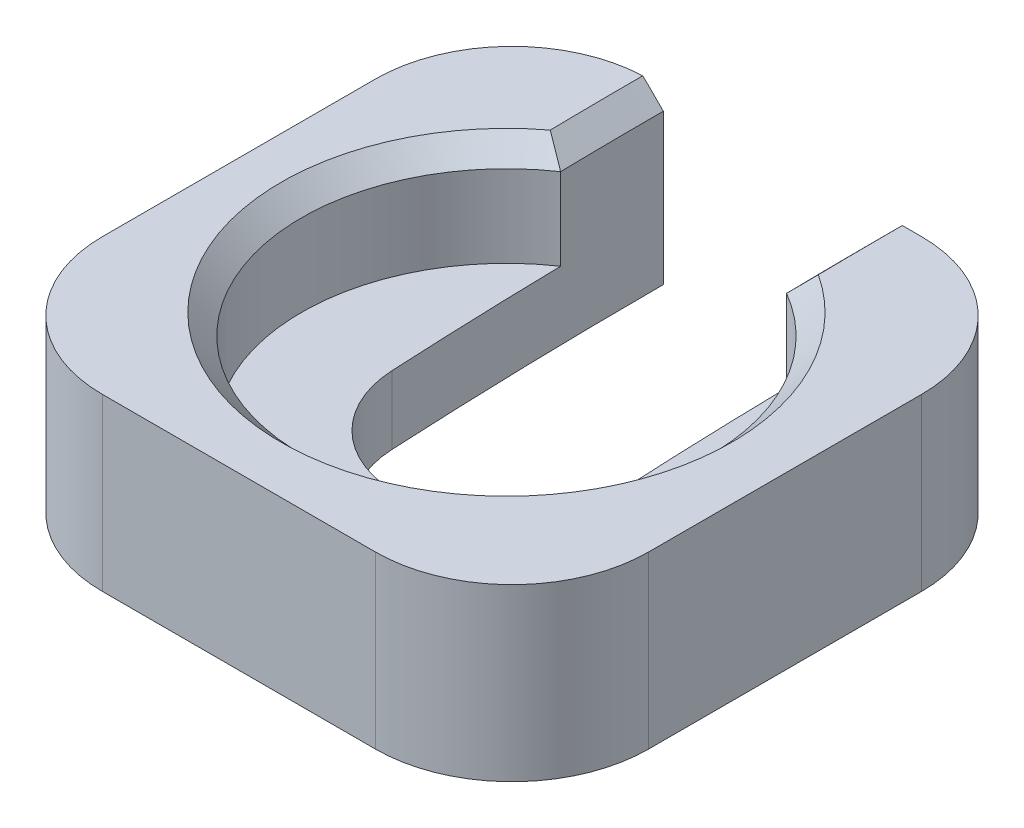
ISO-10303-21;
HEADER;
FILE_DESCRIPTION(('STEP AP214'),'2;1');
FILE_NAME('part.step','',(''),(''),'','','');
FILE_SCHEMA(('AUTOMOTIVE_DESIGN { 1 0 10303 214 1 1 1 1 }'));
ENDSEC;
DATA;
#1=APPLICATION_CONTEXT('core data for automotive mechanical design processes');
#2=APPLICATION_PROTOCOL_DEFINITION('international standard','automotive_design',2000,#1);
#3=PRODUCT_CONTEXT('',#1,'mechanical');
#4=PRODUCT('Part','Part','',(#3));
#5=PRODUCT_RELATED_PRODUCT_CATEGORY('part','',(#4));
#6=PRODUCT_DEFINITION_FORMATION('','',#4);
#7=PRODUCT_DEFINITION_CONTEXT('part definition',#1,'design');
#8=PRODUCT_DEFINITION('design','',#6,#7);
#9=PRODUCT_DEFINITION_SHAPE('','',#8);
#10=(LENGTH_UNIT() NAMED_UNIT(*) SI_UNIT(.MILLI.,.METRE.));
#11=(NAMED_UNIT(*) PLANE_ANGLE_UNIT() SI_UNIT($,.RADIAN.));
#12=(NAMED_UNIT(*) SI_UNIT($,.STERADIAN.) SOLID_ANGLE_UNIT());
#13=UNCERTAINTY_MEASURE_WITH_UNIT(LENGTH_MEASURE(1.E-05),#10,'distance_accuracy_value','');
#14=(GEOMETRIC_REPRESENTATION_CONTEXT(3) GLOBAL_UNCERTAINTY_ASSIGNED_CONTEXT((#13)) GLOBAL_UNIT_ASSIGNED_CONTEXT((#10,
#11,#12)) REPRESENTATION_CONTEXT('',''));
#15=CARTESIAN_POINT('',(0.,0.,0.));
#16=DIRECTION('',(0.,0.,1.));
#17=DIRECTION('',(1.,0.,0.));
#18=AXIS2_PLACEMENT_3D('',#15,#16,#17);
#19=CARTESIAN_POINT('',(-0.0814249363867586,2.5,4.));
#20=DIRECTION('',(0.,-1.,0.));
#21=DIRECTION('',(0.,0.,-1.));
#22=AXIS2_PLACEMENT_3D('',#19,#20,#21);
#23=CYLINDRICAL_SURFACE('',#22,1.6);
#24=CARTESIAN_POINT('',(-0.0814249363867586,1.,4.));
#25=DIRECTION('',(0.,1.,0.));
#26=DIRECTION('',(0.,0.,1.));
#27=AXIS2_PLACEMENT_3D('',#24,#25,#26);
#28=CIRCLE('',#27,1.6);
#29=CARTESIAN_POINT('',(1.516501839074,1.,3.91857506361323));
#30=VERTEX_POINT('',#29);
#31=CARTESIAN_POINT('',(-1.67935171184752,1.,4.08142493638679));
#32=VERTEX_POINT('',#31);
#33=EDGE_CURVE('E164',#30,#32,#28,.F.);
#34=ORIENTED_EDGE('',*,*,#33,.F.);
#35=DIRECTION('',(0.,-1.,0.));
#36=VECTOR('',#35,1.);
#37=CARTESIAN_POINT('',(1.516501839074,2.5,3.91857506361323));
#38=LINE('',#37,#36);
#39=CARTESIAN_POINT('',(1.516501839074,0.,3.91857506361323));
#40=VERTEX_POINT('',#39);
#41=EDGE_CURVE('E179',#30,#40,#38,.T.);
#42=ORIENTED_EDGE('',*,*,#41,.T.);
#43=CARTESIAN_POINT('',(-0.0814249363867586,0.,4.));
#44=DIRECTION('',(0.,-1.,0.));
#45=DIRECTION('',(0.,0.,-1.));
#46=AXIS2_PLACEMENT_3D('',#43,#44,#45);
#47=CIRCLE('',#46,1.6);
#48=CARTESIAN_POINT('',(-1.67935171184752,0.,4.08142493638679));
#49=VERTEX_POINT('',#48);
#50=EDGE_CURVE('E182',#40,#49,#47,.T.);
#51=ORIENTED_EDGE('',*,*,#50,.T.);
#52=DIRECTION('',(0.,-1.,0.));
#53=VECTOR('',#52,1.);
#54=CARTESIAN_POINT('',(-1.67935171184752,2.5,4.08142493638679));
#55=LINE('',#54,#53);
#56=EDGE_CURVE('E218',#32,#49,#55,.T.);
#57=ORIENTED_EDGE('',*,*,#56,.F.);
#58=EDGE_LOOP('',(#34,#42,#51,#57));
#59=FACE_BOUND('',#58,.T.);
#60=ADVANCED_FACE('F36',(#59),#23,.F.);
#61=CARTESIAN_POINT('',(78.4167279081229,2.5,0.));
#62=DIRECTION('',(0.,-1.,0.));
#63=DIRECTION('',(0.,0.,-1.));
#64=AXIS2_PLACEMENT_3D('',#61,#62,#63);
#65=CYLINDRICAL_SURFACE('',#64,77.);
#66=DIRECTION('',(0.,1.,0.));
#67=VECTOR('',#66,1.);
#68=CARTESIAN_POINT('',(1.42960807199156,1.75,1.4083250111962));
#69=LINE('',#68,#67);
#70=CARTESIAN_POINT('',(1.42960807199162,1.,1.40832501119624));
#71=VERTEX_POINT('',#70);
#72=CARTESIAN_POINT('',(1.42960807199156,2.19999999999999,1.4083250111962));
#73=VERTEX_POINT('',#72);
#74=EDGE_CURVE('E154',#71,#73,#69,.T.);
#75=ORIENTED_EDGE('',*,*,#74,.T.);
#76=CARTESIAN_POINT('',(78.4167279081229,2.19999999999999,0.));
#77=DIRECTION('',(0.,-1.,0.));
#78=DIRECTION('',(0.,0.,-1.));
#79=AXIS2_PLACEMENT_3D('',#76,#77,#78);
#80=CIRCLE('',#79,77.);
#81=CARTESIAN_POINT('',(1.4167279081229,2.19999999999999,0.));
#82=VERTEX_POINT('',#81);
#83=EDGE_CURVE('E234',#73,#82,#80,.T.);
#84=ORIENTED_EDGE('',*,*,#83,.T.);
#85=DIRECTION('',(0.,-1.,0.));
#86=VECTOR('',#85,1.);
#87=CARTESIAN_POINT('',(1.4167279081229,2.5,0.));
#88=LINE('',#87,#86);
#89=CARTESIAN_POINT('',(1.4167279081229,0.,0.));
#90=VERTEX_POINT('',#89);
#91=EDGE_CURVE('E196',#82,#90,#88,.T.);
#92=ORIENTED_EDGE('',*,*,#91,.T.);
#93=CARTESIAN_POINT('',(78.4167279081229,0.,0.));
#94=DIRECTION('',(0.,1.,0.));
#95=DIRECTION('',(0.,0.,-1.));
#96=AXIS2_PLACEMENT_3D('',#93,#94,#95);
#97=CIRCLE('',#96,77.);
#98=EDGE_CURVE('E180',#90,#40,#97,.T.);
#99=ORIENTED_EDGE('',*,*,#98,.T.);
#100=ORIENTED_EDGE('',*,*,#41,.F.);
#101=CARTESIAN_POINT('',(78.4167279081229,1.,0.));
#102=DIRECTION('',(0.,1.,0.));
#103=DIRECTION('',(0.,0.,1.));
#104=AXIS2_PLACEMENT_3D('',#101,#102,#103);
#105=CIRCLE('',#104,77.);
#106=EDGE_CURVE('E170',#71,#30,#105,.T.);
#107=ORIENTED_EDGE('',*,*,#106,.F.);
#108=EDGE_LOOP('',(#75,#84,#92,#99,#100,#107));
#109=FACE_BOUND('',#108,.T.);
#110=ADVANCED_FACE('F177',(#109),#65,.T.);
#111=CARTESIAN_POINT('',(78.4167279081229,2.5,0.));
#112=DIRECTION('',(0.,-1.,0.));
#113=DIRECTION('',(0.,0.,-1.));
#114=AXIS2_PLACEMENT_3D('',#111,#112,#113);
#115=CYLINDRICAL_SURFACE('',#114,80.2);
#116=DIRECTION('',(0.,-1.,0.));
#117=VECTOR('',#116,1.);
#118=CARTESIAN_POINT('',(-1.78327209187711,2.5,0.));
#119=LINE('',#118,#117);
#120=CARTESIAN_POINT('',(-1.78327209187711,2.19999999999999,0.));
#121=VERTEX_POINT('',#120);
#122=CARTESIAN_POINT('',(-1.78327209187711,0.,0.));
#123=VERTEX_POINT('',#122);
#124=EDGE_CURVE('E216',#121,#123,#119,.T.);
#125=ORIENTED_EDGE('',*,*,#124,.F.);
#126=CARTESIAN_POINT('',(78.4167279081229,2.19999999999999,0.));
#127=DIRECTION('',(0.,-1.,0.));
#128=DIRECTION('',(0.,0.,-1.));
#129=AXIS2_PLACEMENT_3D('',#126,#127,#128);
#130=CIRCLE('',#129,80.2);
#131=CARTESIAN_POINT('',(-1.76887488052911,2.19999999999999,1.51957409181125));
#132=VERTEX_POINT('',#131);
#133=EDGE_CURVE('E231',#121,#132,#130,.F.);
#134=ORIENTED_EDGE('',*,*,#133,.T.);
#135=DIRECTION('',(0.,1.,0.));
#136=VECTOR('',#135,1.);
#137=CARTESIAN_POINT('',(-1.76887488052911,1.75,1.51957409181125));
#138=LINE('',#137,#136);
#139=CARTESIAN_POINT('',(-1.76887488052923,1.,1.51957409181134));
#140=VERTEX_POINT('',#139);
#141=EDGE_CURVE('E165',#132,#140,#138,.F.);
#142=ORIENTED_EDGE('',*,*,#141,.T.);
#143=CARTESIAN_POINT('',(78.4167279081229,1.,0.));
#144=DIRECTION('',(0.,1.,0.));
#145=DIRECTION('',(0.,0.,1.));
#146=AXIS2_PLACEMENT_3D('',#143,#144,#145);
#147=CIRCLE('',#146,80.2);
#148=EDGE_CURVE('E173',#32,#140,#147,.F.);
#149=ORIENTED_EDGE('',*,*,#148,.F.);
#150=ORIENTED_EDGE('',*,*,#56,.T.);
#151=CARTESIAN_POINT('',(78.4167279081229,0.,0.));
#152=DIRECTION('',(0.,-1.,0.));
#153=DIRECTION('',(0.,0.,-1.));
#154=AXIS2_PLACEMENT_3D('',#151,#152,#153);
#155=CIRCLE('',#154,80.2);
#156=EDGE_CURVE('E200',#49,#123,#155,.T.);
#157=ORIENTED_EDGE('',*,*,#156,.T.);
#158=EDGE_LOOP('',(#125,#134,#142,#149,#150,#157));
#159=FACE_BOUND('',#158,.T.);
#160=ADVANCED_FACE('F287',(#159),#115,.F.);
#161=CARTESIAN_POINT('',(-3.99999999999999,2.5,0.));
#162=DIRECTION('',(0.,0.,1.));
#163=DIRECTION('',(1.,0.,0.));
#164=AXIS2_PLACEMENT_3D('',#161,#162,#163);
#165=PLANE('',#164);
#166=DIRECTION('',(-1.,0.,0.));
#167=VECTOR('',#166,1.);
#168=CARTESIAN_POINT('',(-3.99999999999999,0.,0.));
#169=LINE('',#168,#167);
#170=CARTESIAN_POINT('',(-2.,0.,0.));
#171=VERTEX_POINT('',#170);
#172=EDGE_CURVE('E203',#123,#171,#169,.T.);
#173=ORIENTED_EDGE('',*,*,#172,.T.);
#174=DIRECTION('',(0.,-1.,0.));
#175=VECTOR('',#174,1.);
#176=CARTESIAN_POINT('',(-2.,2.5,0.));
#177=LINE('',#176,#175);
#178=CARTESIAN_POINT('',(-2.00000000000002,2.41672790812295,0.));
#179=VERTEX_POINT('',#178);
#180=EDGE_CURVE('E48',#171,#179,#177,.F.);
#181=ORIENTED_EDGE('',*,*,#180,.T.);
#182=DIRECTION('',(0.707106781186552,-0.707106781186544,0.));
#183=VECTOR('',#182,1.);
#184=CARTESIAN_POINT('',(78.4167279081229,-77.999999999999,0.));
#185=LINE('',#184,#183);
#186=EDGE_CURVE('E229',#179,#121,#185,.T.);
#187=ORIENTED_EDGE('',*,*,#186,.T.);
#188=ORIENTED_EDGE('',*,*,#124,.T.);
#189=EDGE_LOOP('',(#173,#181,#187,#188));
#190=FACE_BOUND('',#189,.T.);
#191=ADVANCED_FACE('F291',(#190),#165,.F.);
#192=CARTESIAN_POINT('',(-3.99999999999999,2.5,0.));
#193=DIRECTION('',(1.,0.,0.));
#194=DIRECTION('',(0.,0.,-1.));
#195=AXIS2_PLACEMENT_3D('',#192,#193,#194);
#196=PLANE('',#195);
#197=DIRECTION('',(0.,0.,1.));
#198=VECTOR('',#197,1.);
#199=CARTESIAN_POINT('',(-3.99999999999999,2.5,0.));
#200=LINE('',#199,#198);
#201=CARTESIAN_POINT('',(-3.99999999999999,2.5,2.));
#202=VERTEX_POINT('',#201);
#203=CARTESIAN_POINT('',(-3.99999999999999,2.5,6.00000000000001));
#204=VERTEX_POINT('',#203);
#205=EDGE_CURVE('E186',#202,#204,#200,.T.);
#206=ORIENTED_EDGE('',*,*,#205,.F.);
#207=DIRECTION('',(0.,-1.,0.));
#208=VECTOR('',#207,1.);
#209=CARTESIAN_POINT('',(-3.99999999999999,2.5,2.));
#210=LINE('',#209,#208);
#211=CARTESIAN_POINT('',(-3.99999999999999,0.,2.));
#212=VERTEX_POINT('',#211);
#213=EDGE_CURVE('E466',#202,#212,#210,.T.);
#214=ORIENTED_EDGE('',*,*,#213,.T.);
#215=DIRECTION('',(0.,0.,1.));
#216=VECTOR('',#215,1.);
#217=CARTESIAN_POINT('',(-3.99999999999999,0.,0.));
#218=LINE('',#217,#216);
#219=CARTESIAN_POINT('',(-3.99999999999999,0.,6.00000000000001));
#220=VERTEX_POINT('',#219);
#221=EDGE_CURVE('E205',#212,#220,#218,.T.);
#222=ORIENTED_EDGE('',*,*,#221,.T.);
#223=DIRECTION('',(0.,-1.,0.));
#224=VECTOR('',#223,1.);
#225=CARTESIAN_POINT('',(-3.99999999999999,2.5,6.00000000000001));
#226=LINE('',#225,#224);
#227=EDGE_CURVE('E481',#220,#204,#226,.F.);
#228=ORIENTED_EDGE('',*,*,#227,.T.);
#229=EDGE_LOOP('',(#206,#214,#222,#228));
#230=FACE_BOUND('',#229,.T.);
#231=ADVANCED_FACE('F295',(#230),#196,.F.);
#232=CARTESIAN_POINT('',(-3.99999999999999,2.5,8.00000000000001));
#233=DIRECTION('',(0.,0.,-1.));
#234=DIRECTION('',(-1.,0.,0.));
#235=AXIS2_PLACEMENT_3D('',#232,#233,#234);
#236=PLANE('',#235);
#237=DIRECTION('',(1.,0.,0.));
#238=VECTOR('',#237,1.);
#239=CARTESIAN_POINT('',(-3.99999999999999,0.,8.00000000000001));
#240=LINE('',#239,#238);
#241=CARTESIAN_POINT('',(-1.99999999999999,0.,8.00000000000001));
#242=VERTEX_POINT('',#241);
#243=CARTESIAN_POINT('',(2.00000000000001,0.,8.00000000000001));
#244=VERTEX_POINT('',#243);
#245=EDGE_CURVE('E208',#242,#244,#240,.T.);
#246=ORIENTED_EDGE('',*,*,#245,.T.);
#247=DIRECTION('',(0.,-1.,0.));
#248=VECTOR('',#247,1.);
#249=CARTESIAN_POINT('',(2.00000000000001,2.5,8.00000000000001));
#250=LINE('',#249,#248);
#251=CARTESIAN_POINT('',(2.00000000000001,2.5,8.00000000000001));
#252=VERTEX_POINT('',#251);
#253=EDGE_CURVE('E62',#244,#252,#250,.F.);
#254=ORIENTED_EDGE('',*,*,#253,.T.);
#255=DIRECTION('',(1.,0.,0.));
#256=VECTOR('',#255,1.);
#257=CARTESIAN_POINT('',(-3.99999999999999,2.5,8.00000000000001));
#258=LINE('',#257,#256);
#259=CARTESIAN_POINT('',(-1.99999999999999,2.5,8.00000000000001));
#260=VERTEX_POINT('',#259);
#261=EDGE_CURVE('E189',#260,#252,#258,.T.);
#262=ORIENTED_EDGE('',*,*,#261,.F.);
#263=DIRECTION('',(0.,-1.,0.));
#264=VECTOR('',#263,1.);
#265=CARTESIAN_POINT('',(-1.99999999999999,2.5,8.00000000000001));
#266=LINE('',#265,#264);
#267=EDGE_CURVE('E477',#260,#242,#266,.T.);
#268=ORIENTED_EDGE('',*,*,#267,.T.);
#269=EDGE_LOOP('',(#246,#254,#262,#268));
#270=FACE_BOUND('',#269,.T.);
#271=ADVANCED_FACE('F298',(#270),#236,.F.);
#272=CARTESIAN_POINT('',(4.00000000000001,2.5,0.));
#273=DIRECTION('',(-1.,0.,0.));
#274=DIRECTION('',(0.,0.,1.));
#275=AXIS2_PLACEMENT_3D('',#272,#273,#274);
#276=PLANE('',#275);
#277=DIRECTION('',(0.,0.,-1.));
#278=VECTOR('',#277,1.);
#279=CARTESIAN_POINT('',(4.00000000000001,0.,0.));
#280=LINE('',#279,#278);
#281=CARTESIAN_POINT('',(4.00000000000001,0.,6.00000000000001));
#282=VERTEX_POINT('',#281);
#283=CARTESIAN_POINT('',(4.00000000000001,0.,2.));
#284=VERTEX_POINT('',#283);
#285=EDGE_CURVE('E210',#282,#284,#280,.T.);
#286=ORIENTED_EDGE('',*,*,#285,.T.);
#287=DIRECTION('',(0.,-1.,0.));
#288=VECTOR('',#287,1.);
#289=CARTESIAN_POINT('',(4.00000000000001,2.5,2.));
#290=LINE('',#289,#288);
#291=CARTESIAN_POINT('',(4.00000000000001,2.5,2.));
#292=VERTEX_POINT('',#291);
#293=EDGE_CURVE('E472',#284,#292,#290,.F.);
#294=ORIENTED_EDGE('',*,*,#293,.T.);
#295=DIRECTION('',(0.,0.,-1.));
#296=VECTOR('',#295,1.);
#297=CARTESIAN_POINT('',(4.00000000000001,2.5,0.));
#298=LINE('',#297,#296);
#299=CARTESIAN_POINT('',(4.00000000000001,2.5,6.00000000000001));
#300=VERTEX_POINT('',#299);
#301=EDGE_CURVE('E192',#300,#292,#298,.T.);
#302=ORIENTED_EDGE('',*,*,#301,.F.);
#303=DIRECTION('',(0.,-1.,0.));
#304=VECTOR('',#303,1.);
#305=CARTESIAN_POINT('',(4.00000000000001,2.5,6.00000000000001));
#306=LINE('',#305,#304);
#307=EDGE_CURVE('E495',#300,#282,#306,.T.);
#308=ORIENTED_EDGE('',*,*,#307,.T.);
#309=EDGE_LOOP('',(#286,#294,#302,#308));
#310=FACE_BOUND('',#309,.T.);
#311=ADVANCED_FACE('F302',(#310),#276,.F.);
#312=CARTESIAN_POINT('',(1.4167279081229,2.5,0.));
#313=DIRECTION('',(0.,0.,1.));
#314=DIRECTION('',(1.,0.,0.));
#315=AXIS2_PLACEMENT_3D('',#312,#313,#314);
#316=PLANE('',#315);
#317=DIRECTION('',(-1.,0.,0.));
#318=VECTOR('',#317,1.);
#319=CARTESIAN_POINT('',(1.4167279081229,2.5,0.));
#320=LINE('',#319,#318);
#321=CARTESIAN_POINT('',(2.,2.5,0.));
#322=VERTEX_POINT('',#321);
#323=CARTESIAN_POINT('',(1.71672790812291,2.5,0.));
#324=VERTEX_POINT('',#323);
#325=EDGE_CURVE('E195',#322,#324,#320,.T.);
#326=ORIENTED_EDGE('',*,*,#325,.F.);
#327=DIRECTION('',(0.,-1.,0.));
#328=VECTOR('',#327,1.);
#329=CARTESIAN_POINT('',(2.,2.5,0.));
#330=LINE('',#329,#328);
#331=CARTESIAN_POINT('',(2.,0.,0.));
#332=VERTEX_POINT('',#331);
#333=EDGE_CURVE('E239',#322,#332,#330,.T.);
#334=ORIENTED_EDGE('',*,*,#333,.T.);
#335=DIRECTION('',(-1.,0.,0.));
#336=VECTOR('',#335,1.);
#337=CARTESIAN_POINT('',(1.4167279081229,0.,0.));
#338=LINE('',#337,#336);
#339=EDGE_CURVE('E190',#332,#90,#338,.T.);
#340=ORIENTED_EDGE('',*,*,#339,.T.);
#341=ORIENTED_EDGE('',*,*,#91,.F.);
#342=DIRECTION('',(-0.707106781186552,-0.707106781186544,0.));
#343=VECTOR('',#342,1.);
#344=CARTESIAN_POINT('',(78.4167279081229,79.1999999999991,0.));
#345=LINE('',#344,#343);
#346=EDGE_CURVE('E236',#82,#324,#345,.F.);
#347=ORIENTED_EDGE('',*,*,#346,.T.);
#348=EDGE_LOOP('',(#326,#334,#340,#341,#347));
#349=FACE_BOUND('',#348,.T.);
#350=ADVANCED_FACE('F305',(#349),#316,.F.);
#351=CARTESIAN_POINT('',(78.4167279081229,2.5,0.));
#352=DIRECTION('',(0.,-1.,0.));
#353=DIRECTION('',(0.,0.,-1.));
#354=AXIS2_PLACEMENT_3D('',#351,#352,#353);
#355=PLANE('',#354);
#356=ORIENTED_EDGE('',*,*,#301,.T.);
#357=CARTESIAN_POINT('',(2.00000000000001,2.5,2.));
#358=DIRECTION('',(0.,-1.,0.));
#359=DIRECTION('',(0.,0.,-1.));
#360=AXIS2_PLACEMENT_3D('',#357,#358,#359);
#361=CIRCLE('',#360,2.);
#362=EDGE_CURVE('E470',#292,#322,#361,.F.);
#363=ORIENTED_EDGE('',*,*,#362,.T.);
#364=ORIENTED_EDGE('',*,*,#325,.T.);
#365=CARTESIAN_POINT('',(78.4167279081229,2.5,0.));
#366=DIRECTION('',(0.,-1.,0.));
#367=DIRECTION('',(0.,0.,-1.));
#368=AXIS2_PLACEMENT_3D('',#365,#366,#367);
#369=CIRCLE('',#368,76.7);
#370=CARTESIAN_POINT('',(1.72674346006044,2.5,1.23946978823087));
#371=VERTEX_POINT('',#370);
#372=EDGE_CURVE('E222',#324,#371,#369,.F.);
#373=ORIENTED_EDGE('',*,*,#372,.T.);
#374=CARTESIAN_POINT('',(-0.0814249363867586,2.5,4.));
#375=DIRECTION('',(0.,-1.,0.));
#376=DIRECTION('',(0.,0.,-1.));
#377=AXIS2_PLACEMENT_3D('',#374,#375,#376);
#378=CIRCLE('',#377,3.3);
#379=CARTESIAN_POINT('',(-2.07165256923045,2.5,1.36770177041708));
#380=VERTEX_POINT('',#379);
#381=EDGE_CURVE('E224',#371,#380,#378,.T.);
#382=ORIENTED_EDGE('',*,*,#381,.T.);
#383=CARTESIAN_POINT('',(78.4167279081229,2.5,0.));
#384=DIRECTION('',(0.,-1.,0.));
#385=DIRECTION('',(0.,0.,-1.));
#386=AXIS2_PLACEMENT_3D('',#383,#384,#385);
#387=CIRCLE('',#386,80.5);
#388=CARTESIAN_POINT('',(-2.08327207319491,2.5,0.00173431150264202));
#389=VERTEX_POINT('',#388);
#390=EDGE_CURVE('E226',#380,#389,#387,.T.);
#391=ORIENTED_EDGE('',*,*,#390,.T.);
#392=CARTESIAN_POINT('',(-1.99999999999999,2.5,2.));
#393=DIRECTION('',(0.,-1.,0.));
#394=DIRECTION('',(0.,0.,-1.));
#395=AXIS2_PLACEMENT_3D('',#392,#393,#394);
#396=CIRCLE('',#395,2.);
#397=EDGE_CURVE('E462',#389,#202,#396,.F.);
#398=ORIENTED_EDGE('',*,*,#397,.T.);
#399=ORIENTED_EDGE('',*,*,#205,.T.);
#400=CARTESIAN_POINT('',(-1.99999999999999,2.5,6.00000000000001));
#401=DIRECTION('',(0.,-1.,0.));
#402=DIRECTION('',(0.,0.,-1.));
#403=AXIS2_PLACEMENT_3D('',#400,#401,#402);
#404=CIRCLE('',#403,2.);
#405=EDGE_CURVE('E468',#204,#260,#404,.F.);
#406=ORIENTED_EDGE('',*,*,#405,.T.);
#407=ORIENTED_EDGE('',*,*,#261,.T.);
#408=CARTESIAN_POINT('',(2.00000000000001,2.5,6.00000000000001));
#409=DIRECTION('',(0.,-1.,0.));
#410=DIRECTION('',(0.,0.,-1.));
#411=AXIS2_PLACEMENT_3D('',#408,#409,#410);
#412=CIRCLE('',#411,2.);
#413=EDGE_CURVE('E467',#252,#300,#412,.F.);
#414=ORIENTED_EDGE('',*,*,#413,.T.);
#415=EDGE_LOOP('',(#356,#363,#364,#373,#382,#391,#398,#399,#406,#407,#414));
#416=FACE_BOUND('',#415,.T.);
#417=ADVANCED_FACE('F309',(#416),#355,.F.);
#418=CARTESIAN_POINT('',(78.4167279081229,0.,0.));
#419=DIRECTION('',(0.,-1.,0.));
#420=DIRECTION('',(0.,0.,-1.));
#421=AXIS2_PLACEMENT_3D('',#418,#419,#420);
#422=PLANE('',#421);
#423=ORIENTED_EDGE('',*,*,#339,.F.);
#424=CARTESIAN_POINT('',(2.00000000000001,0.,2.));
#425=DIRECTION('',(0.,-1.,0.));
#426=DIRECTION('',(0.,0.,-1.));
#427=AXIS2_PLACEMENT_3D('',#424,#425,#426);
#428=CIRCLE('',#427,2.);
#429=EDGE_CURVE('E452',#332,#284,#428,.T.);
#430=ORIENTED_EDGE('',*,*,#429,.T.);
#431=ORIENTED_EDGE('',*,*,#285,.F.);
#432=CARTESIAN_POINT('',(2.00000000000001,0.,6.00000000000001));
#433=DIRECTION('',(0.,-1.,0.));
#434=DIRECTION('',(0.,0.,-1.));
#435=AXIS2_PLACEMENT_3D('',#432,#433,#434);
#436=CIRCLE('',#435,2.);
#437=EDGE_CURVE('E490',#282,#244,#436,.T.);
#438=ORIENTED_EDGE('',*,*,#437,.T.);
#439=ORIENTED_EDGE('',*,*,#245,.F.);
#440=CARTESIAN_POINT('',(-1.99999999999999,0.,6.00000000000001));
#441=DIRECTION('',(0.,-1.,0.));
#442=DIRECTION('',(0.,0.,-1.));
#443=AXIS2_PLACEMENT_3D('',#440,#441,#442);
#444=CIRCLE('',#443,2.);
#445=EDGE_CURVE('E487',#242,#220,#444,.T.);
#446=ORIENTED_EDGE('',*,*,#445,.T.);
#447=ORIENTED_EDGE('',*,*,#221,.F.);
#448=CARTESIAN_POINT('',(-1.99999999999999,0.,2.));
#449=DIRECTION('',(0.,-1.,0.));
#450=DIRECTION('',(0.,0.,-1.));
#451=AXIS2_PLACEMENT_3D('',#448,#449,#450);
#452=CIRCLE('',#451,2.);
#453=EDGE_CURVE('E485',#212,#171,#452,.T.);
#454=ORIENTED_EDGE('',*,*,#453,.T.);
#455=ORIENTED_EDGE('',*,*,#172,.F.);
#456=ORIENTED_EDGE('',*,*,#156,.F.);
#457=ORIENTED_EDGE('',*,*,#50,.F.);
#458=ORIENTED_EDGE('',*,*,#98,.F.);
#459=EDGE_LOOP('',(#423,#430,#431,#438,#439,#446,#447,#454,#455,#456,#457,#458));
#460=FACE_BOUND('',#459,.T.);
#461=ADVANCED_FACE('F311',(#460),#422,.T.);
#462=CARTESIAN_POINT('',(-0.0814249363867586,1.,4.));
#463=DIRECTION('',(0.,1.,0.));
#464=DIRECTION('',(0.,0.,1.));
#465=AXIS2_PLACEMENT_3D('',#462,#463,#464);
#466=PLANE('',#465);
#467=ORIENTED_EDGE('',*,*,#106,.T.);
#468=ORIENTED_EDGE('',*,*,#33,.T.);
#469=ORIENTED_EDGE('',*,*,#148,.T.);
#470=CARTESIAN_POINT('',(-0.0814249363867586,1.,4.));
#471=DIRECTION('',(0.,1.,0.));
#472=DIRECTION('',(0.,0.,1.));
#473=AXIS2_PLACEMENT_3D('',#470,#471,#472);
#474=CIRCLE('',#473,3.);
#475=EDGE_CURVE('E158',#140,#71,#474,.T.);
#476=ORIENTED_EDGE('',*,*,#475,.T.);
#477=EDGE_LOOP('',(#467,#468,#469,#476));
#478=FACE_BOUND('',#477,.T.);
#479=ADVANCED_FACE('F169',(#478),#466,.T.);
#480=CARTESIAN_POINT('',(-0.0814249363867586,1.,4.));
#481=DIRECTION('',(0.,1.,0.));
#482=DIRECTION('',(0.,0.,1.));
#483=AXIS2_PLACEMENT_3D('',#480,#481,#482);
#484=CYLINDRICAL_SURFACE('',#483,3.);
#485=ORIENTED_EDGE('',*,*,#141,.F.);
#486=CARTESIAN_POINT('',(-0.0814249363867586,2.19999999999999,4.));
#487=DIRECTION('',(0.,-1.,0.));
#488=DIRECTION('',(0.,0.,-1.));
#489=AXIS2_PLACEMENT_3D('',#486,#487,#488);
#490=CIRCLE('',#489,3.);
#491=EDGE_CURVE('E160',#132,#73,#490,.F.);
#492=ORIENTED_EDGE('',*,*,#491,.T.);
#493=ORIENTED_EDGE('',*,*,#74,.F.);
#494=ORIENTED_EDGE('',*,*,#475,.F.);
#495=EDGE_LOOP('',(#485,#492,#493,#494));
#496=FACE_BOUND('',#495,.T.);
#497=ADVANCED_FACE('F157',(#496),#484,.F.);
#498=CARTESIAN_POINT('',(78.4167279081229,2.5,0.));
#499=DIRECTION('',(0.,-1.,0.));
#500=DIRECTION('',(0.,0.,-1.));
#501=AXIS2_PLACEMENT_3D('',#498,#499,#500);
#502=CONICAL_SURFACE('',#501,76.7,0.785398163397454);
#503=ORIENTED_EDGE('',*,*,#346,.F.);
#504=ORIENTED_EDGE('',*,*,#83,.F.);
#505=CARTESIAN_POINT('',(1.42960807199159,2.19999999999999,1.4083250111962));
#506=CARTESIAN_POINT('',(1.47889648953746,2.24980792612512,1.37942892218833));
#507=CARTESIAN_POINT('',(1.52830201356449,2.29971192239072,1.35090959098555));
#508=CARTESIAN_POINT('',(1.62734714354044,2.39971192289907,1.29462451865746));
#509=CARTESIAN_POINT('',(1.6769867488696,2.4498079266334,1.2668587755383));
#510=CARTESIAN_POINT('',(1.72674346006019,2.4999999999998,1.23946978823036));
#511=B_SPLINE_CURVE_WITH_KNOTS('',3,(#505,#506,#507,#508,#509,#510),.UNSPECIFIED.,.F.,.F.,(4,2,
4),(0.,0.22738074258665,0.454760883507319),.UNSPECIFIED.);
#512=EDGE_CURVE('E174',#371,#73,#511,.F.);
#513=ORIENTED_EDGE('',*,*,#512,.F.);
#514=ORIENTED_EDGE('',*,*,#372,.F.);
#515=EDGE_LOOP('',(#503,#504,#513,#514));
#516=FACE_BOUND('',#515,.T.);
#517=ADVANCED_FACE('F260',(#516),#502,.T.);
#518=CARTESIAN_POINT('',(-0.0814249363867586,2.5,4.));
#519=DIRECTION('',(0.,1.,0.));
#520=DIRECTION('',(0.,0.,1.));
#521=AXIS2_PLACEMENT_3D('',#518,#519,#520);
#522=CONICAL_SURFACE('',#521,3.3,0.785398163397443);
#523=ORIENTED_EDGE('',*,*,#512,.T.);
#524=ORIENTED_EDGE('',*,*,#491,.F.);
#525=CARTESIAN_POINT('',(-1.76887488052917,2.19999999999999,1.51957409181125));
#526=CARTESIAN_POINT('',(-1.81918507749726,2.2498093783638,1.49358071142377));
#527=CARTESIAN_POINT('',(-1.86957167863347,2.29971409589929,1.46792798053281));
#528=CARTESIAN_POINT('',(-1.97049757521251,2.39971409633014,1.41730387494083));
#529=CARTESIAN_POINT('',(-2.02103687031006,2.44980937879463,1.39233249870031));
#530=CARTESIAN_POINT('',(-2.07165256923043,2.49999999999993,1.3677017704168));
#531=B_SPLINE_CURVE_WITH_KNOTS('',3,(#525,#526,#527,#528,#529,#530),.UNSPECIFIED.,.F.,.F.,(4,2,
4),(0.,0.226243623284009,0.452486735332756),.UNSPECIFIED.);
#532=EDGE_CURVE('E240',#380,#132,#531,.F.);
#533=ORIENTED_EDGE('',*,*,#532,.F.);
#534=ORIENTED_EDGE('',*,*,#381,.F.);
#535=EDGE_LOOP('',(#523,#524,#533,#534));
#536=FACE_BOUND('',#535,.T.);
#537=ADVANCED_FACE('F252',(#536),#522,.F.);
#538=CARTESIAN_POINT('',(78.4167279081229,2.5,0.));
#539=DIRECTION('',(0.,1.,0.));
#540=DIRECTION('',(0.,0.,1.));
#541=AXIS2_PLACEMENT_3D('',#538,#539,#540);
#542=CONICAL_SURFACE('',#541,80.5,0.785398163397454);
#543=ORIENTED_EDGE('',*,*,#186,.F.);
#544=CARTESIAN_POINT('',(-2.,2.41672790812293,0.));
#545=CARTESIAN_POINT('',(-2.01388169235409,2.43060959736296,-3.12667950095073E-08));
#546=CARTESIAN_POINT('',(-2.02776187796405,2.44448978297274,0.000144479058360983));
#547=CARTESIAN_POINT('',(-2.05551923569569,2.47224714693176,0.000722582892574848));
#548=CARTESIAN_POINT('',(-2.06939640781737,2.48612432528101,0.00115617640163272));
#549=CARTESIAN_POINT('',(-2.0832720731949,2.5,0.00173431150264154));
#550=B_SPLINE_CURVE_WITH_KNOTS('',3,(#544,#545,#546,#547,#548,#549),.UNSPECIFIED.,.F.,.F.,(4,2,
4),(0.,0.0588902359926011,0.117780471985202),.UNSPECIFIED.);
#551=EDGE_CURVE('E11',#179,#389,#550,.T.);
#552=ORIENTED_EDGE('',*,*,#551,.T.);
#553=ORIENTED_EDGE('',*,*,#390,.F.);
#554=ORIENTED_EDGE('',*,*,#532,.T.);
#555=ORIENTED_EDGE('',*,*,#133,.F.);
#556=EDGE_LOOP('',(#543,#552,#553,#554,#555));
#557=FACE_BOUND('',#556,.T.);
#558=ADVANCED_FACE('F255',(#557),#542,.F.);
#559=CARTESIAN_POINT('',(2.00000000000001,2.5,2.));
#560=DIRECTION('',(0.,-1.,0.));
#561=DIRECTION('',(0.,0.,-1.));
#562=AXIS2_PLACEMENT_3D('',#559,#560,#561);
#563=CYLINDRICAL_SURFACE('',#562,2.);
#564=ORIENTED_EDGE('',*,*,#362,.F.);
#565=ORIENTED_EDGE('',*,*,#293,.F.);
#566=ORIENTED_EDGE('',*,*,#429,.F.);
#567=ORIENTED_EDGE('',*,*,#333,.F.);
#568=EDGE_LOOP('',(#564,#565,#566,#567));
#569=FACE_BOUND('',#568,.T.);
#570=ADVANCED_FACE('F258',(#569),#563,.T.);
#571=CARTESIAN_POINT('',(2.00000000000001,2.5,6.00000000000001));
#572=DIRECTION('',(0.,-1.,0.));
#573=DIRECTION('',(0.,0.,-1.));
#574=AXIS2_PLACEMENT_3D('',#571,#572,#573);
#575=CYLINDRICAL_SURFACE('',#574,2.);
#576=ORIENTED_EDGE('',*,*,#413,.F.);
#577=ORIENTED_EDGE('',*,*,#253,.F.);
#578=ORIENTED_EDGE('',*,*,#437,.F.);
#579=ORIENTED_EDGE('',*,*,#307,.F.);
#580=EDGE_LOOP('',(#576,#577,#578,#579));
#581=FACE_BOUND('',#580,.T.);
#582=ADVANCED_FACE('F268',(#581),#575,.T.);
#583=CARTESIAN_POINT('',(-1.99999999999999,2.5,2.));
#584=DIRECTION('',(0.,-1.,0.));
#585=DIRECTION('',(0.,0.,-1.));
#586=AXIS2_PLACEMENT_3D('',#583,#584,#585);
#587=CYLINDRICAL_SURFACE('',#586,2.);
#588=ORIENTED_EDGE('',*,*,#551,.F.);
#589=ORIENTED_EDGE('',*,*,#180,.F.);
#590=ORIENTED_EDGE('',*,*,#453,.F.);
#591=ORIENTED_EDGE('',*,*,#213,.F.);
#592=ORIENTED_EDGE('',*,*,#397,.F.);
#593=EDGE_LOOP('',(#588,#589,#590,#591,#592));
#594=FACE_BOUND('',#593,.T.);
#595=ADVANCED_FACE('F271',(#594),#587,.T.);
#596=CARTESIAN_POINT('',(-1.99999999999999,2.5,6.00000000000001));
#597=DIRECTION('',(0.,-1.,0.));
#598=DIRECTION('',(0.,0.,-1.));
#599=AXIS2_PLACEMENT_3D('',#596,#597,#598);
#600=CYLINDRICAL_SURFACE('',#599,2.);
#601=ORIENTED_EDGE('',*,*,#405,.F.);
#602=ORIENTED_EDGE('',*,*,#227,.F.);
#603=ORIENTED_EDGE('',*,*,#445,.F.);
#604=ORIENTED_EDGE('',*,*,#267,.F.);
#605=EDGE_LOOP('',(#601,#602,#603,#604));
#606=FACE_BOUND('',#605,.T.);
#607=ADVANCED_FACE('F38',(#606),#600,.T.);
#608=CLOSED_SHELL('',(#60,#110,#160,#191,#231,#271,#311,#350,#417,#461,#479,#497,#517,#537,#558,
#570,#582,#595,#607));
#609=MANIFOLD_SOLID_BREP('B2',#608);
#610=ADVANCED_BREP_SHAPE_REPRESENTATION('',(#18,#609),#14);
#611=SHAPE_DEFINITION_REPRESENTATION(#9,#610);
ENDSEC;
END-ISO-10303-21;
